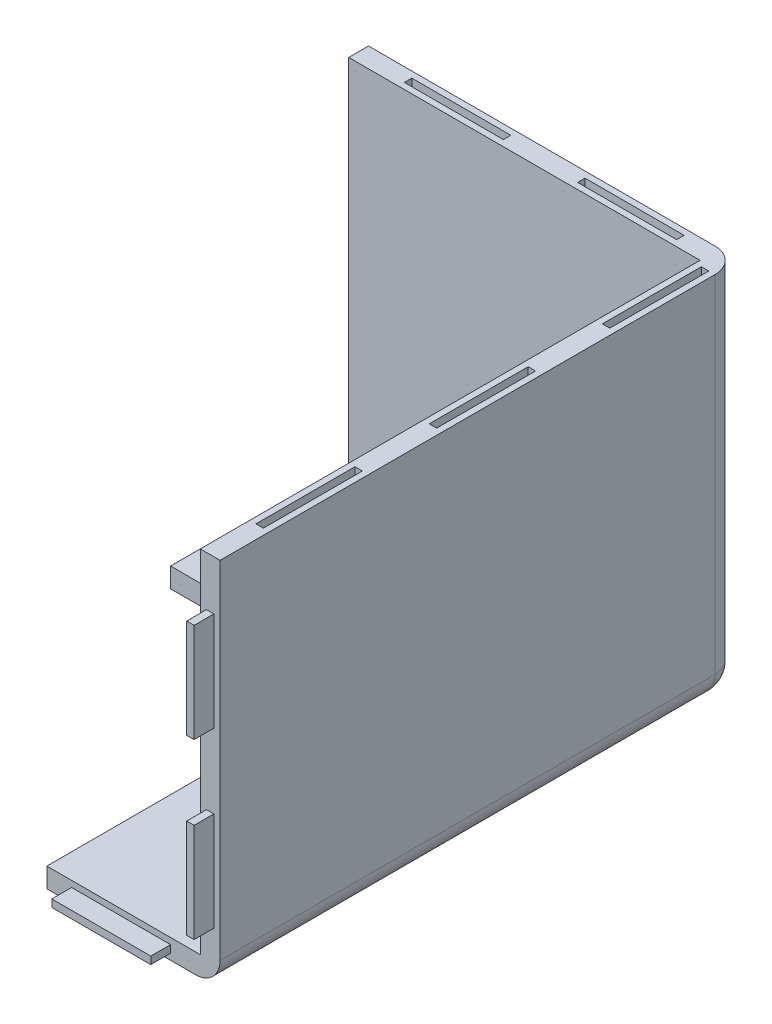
from build123d import *

# Parameters (mm, degrees)
CROQUIS1_W              = 150
CROQUIS1_H              = 210
SALIENTE_EXTRUIR1_DEPTH = 150
CROQUIS2_W              = 142
CROQUIS2_H              = 202
CORTAR_EXTRUIR1_DEPTH   = 142
CROQUIS9_W              = 3
CROQUIS9_H              = 40
CROQUIS9_W_2            = 40
CROQUIS9_H_2            = 3
CORTAR_EXTRUIR5_DEPTH   = 8
CROQUIS10_W             = 3
CROQUIS10_H             = 40
CROQUIS10_W_2           = 40
CROQUIS10_H_2           = 3
SALIENTE_EXTRUIR6_DEPTH = 8
REDONDEO2_R             = 10
CROQUIS11_W             = 80
CROQUIS11_H             = 138
CORTAR_EXTRUIR6_DEPTH   = 10
CROQUIS8_W              = 40
CROQUIS8_H              = 3
CROQUIS8_W_2            = 3
CROQUIS8_H_2            = 40
CORTAR_EXTRUIR7_DEPTH   = 10


with BuildPart() as part:
    # Croquis1 → Saliente-Extruir1 (new body)
    with BuildSketch(Plane(origin=(0, 0, 0), x_dir=(1, 0, 0), z_dir=(0, 1, 0))):
        with Locations((75, 105)):
            Rectangle(CROQUIS1_W, CROQUIS1_H)
    extrude(amount=SALIENTE_EXTRUIR1_DEPTH)

    # Croquis2 → Cortar-Extruir1 (cut)
    with BuildSketch(Plane(origin=(0, 150, 0), x_dir=(1, 0, 0), z_dir=(0, 1, 0))):
        with Locations((71, 101)):
            Rectangle(CROQUIS2_W, CROQUIS2_H)
    extrude(amount=-CORTAR_EXTRUIR1_DEPTH, mode=Mode.SUBTRACT)

    # Croquis9 → Cortar-Extruir5 (cut)
    with BuildSketch(Plane.ZY):
        with Locations((-206, 110)):
            Rectangle(CROQUIS9_W, CROQUIS9_H)
        with Locations((-206, 40)):
            Rectangle(CROQUIS9_W, CROQUIS9_H)
        with Locations((-40, 4)):
            Rectangle(CROQUIS9_W_2, CROQUIS9_H_2)
        with Locations((-110, 4)):
            Rectangle(CROQUIS9_W_2, CROQUIS9_H_2)
        with Locations((-180, 4)):
            Rectangle(CROQUIS9_W_2, CROQUIS9_H_2)
    extrude(amount=-CORTAR_EXTRUIR5_DEPTH, mode=Mode.SUBTRACT)

    # Croquis10 → Saliente-Extruir6 (add)
    with BuildSketch(Plane.XY):
        with Locations((146, 110)):
            Rectangle(CROQUIS10_W, CROQUIS10_H)
        with Locations((146, 40)):
            Rectangle(CROQUIS10_W, CROQUIS10_H)
        with Locations((40, 4)):
            Rectangle(CROQUIS10_W_2, CROQUIS10_H_2)
        with Locations((110, 4)):
            Rectangle(CROQUIS10_W_2, CROQUIS10_H_2)
    extrude(amount=SALIENTE_EXTRUIR6_DEPTH)

    # Redondeo2
    redondeo2_edges = [part.edges().sort_by_distance(p)[0] for p in [
        (75, 0, -210),
        (150, 0, -105),
        (150, 75, -210),
    ]]
    fillet(redondeo2_edges, radius=REDONDEO2_R)

    # Croquis11 → Cortar-Extruir6 (cut)
    with BuildSketch(Plane.XZ):
        with Locations((40, -61)):
            Rectangle(CROQUIS11_W, CROQUIS11_H)
    extrude(amount=-CORTAR_EXTRUIR6_DEPTH, mode=Mode.SUBTRACT)

    # Croquis8 → Cortar-Extruir7 (cut)
    with BuildSketch(Plane(origin=(0, 150, 0), x_dir=(1, 0, 0), z_dir=(0, 1, 0))):
        with Locations((40, 206)):
            Rectangle(CROQUIS8_W, CROQUIS8_H)
        with Locations((110, 206)):
            Rectangle(CROQUIS8_W, CROQUIS8_H)
        with Locations((146, 40)):
            Rectangle(CROQUIS8_W_2, CROQUIS8_H_2)
        with Locations((146, 110)):
            Rectangle(CROQUIS8_W_2, CROQUIS8_H_2)
        with Locations((146, 180)):
            Rectangle(CROQUIS8_W_2, CROQUIS8_H_2)
    extrude(amount=-CORTAR_EXTRUIR7_DEPTH, mode=Mode.SUBTRACT)


solid = part.part
